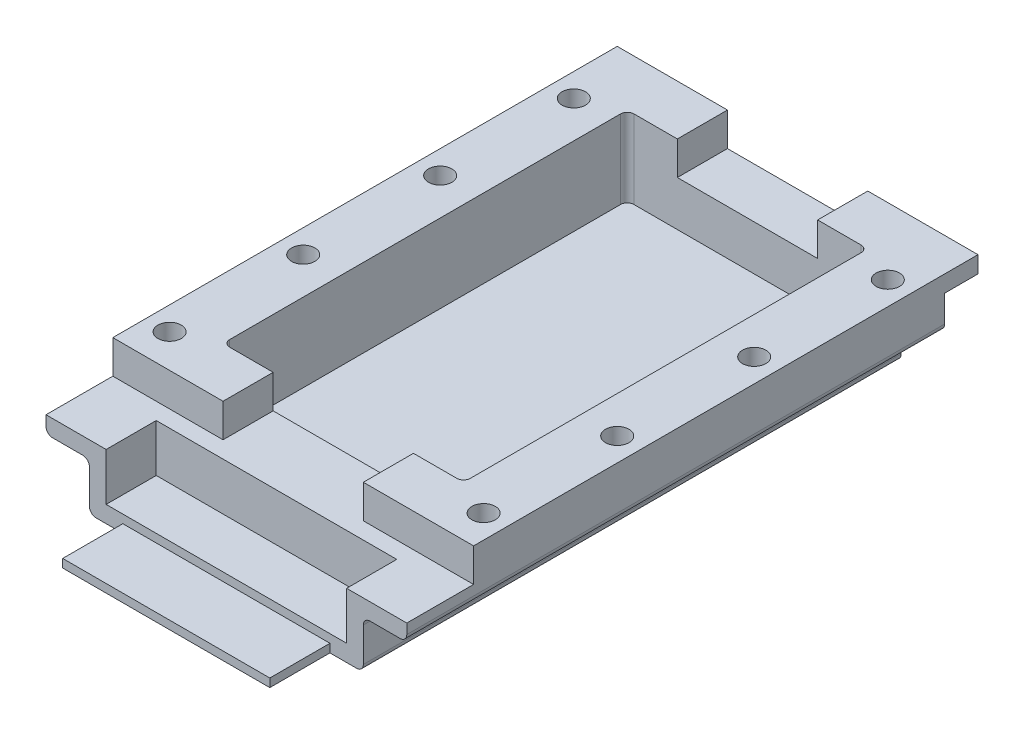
from build123d import *

# Parameters (mm, degrees)
CROQUIS1_W                   = 72
CROQUIS1_H                   = 23.5
SALIENTE_EXTRUIR1_DEPTH      = 15
SALIENTE_EXTRUIR2_DEPTH      = 136
SALIENTE_EXTRUIR2_DEPTH_BACK = 5
CROQUIS6_W                   = 18
CROQUIS6_H                   = 10
SALIENTE_EXTRUIR6_DEPTH      = 5
CROQUIS7_W                   = 62
CROQUIS7_H                   = 18
CORTAR_EXTRUIR1_DEPTH        = 2.5
SALIENTE_EXTRUIR7_REACH      = 180.204
CROQUIS8_W                   = 72
CROQUIS8_H                   = 15
SALIENTE_EXTRUIR8_DEPTH      = 20
CROQUIS10_W                  = 72
CROQUIS10_H                  = 14.25
CORTAR_EXTRUIR2_DEPTH        = 15
CROQUIS11_W                  = 62
CROQUIS11_H                  = 18
SALIENTE_EXTRUIR9_DEPTH      = 2.5
REDONDEO8_R                  = 2
CROQUIS13_W                  = 42
CROQUIS13_H                  = 171
CORTAR_EXTRUIR6_DEPTH        = 10
CROQUIS14_W                  = 5
CROQUIS14_H                  = 15
CORTAR_EXTRUIR7_DEPTH        = 30
REDONDEO9_R                  = 2
REDONDEO10_R                 = 2
CROQUIS15_R                  = 3.5
CORTAR_EXTRUIR8_DEPTH        = 212.368310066
CORTAR_EXTRUIR9_DEPTH        = 10
CORTAR_EXTRUIR9_DEPTH_BACK   = 7
CROQUIS16_R                  = 5.25


with BuildPart() as part:
    # Croquis1 → Saliente-Extruir1 (new body)
    with BuildSketch(Plane.XY):
        with Locations((36, 11.75)):
            Rectangle(CROQUIS1_W, CROQUIS1_H)
    extrude(amount=SALIENTE_EXTRUIR1_DEPTH)

    # Croquis2 → Saliente-Extruir2 (add, two sides: drawn at the far end of the back side and taken through both)
    with BuildSketch(Plane.XY.offset(15).offset(-SALIENTE_EXTRUIR2_DEPTH_BACK)):
        Polygon((0, 23.5), (-18, 23.5), (-18, 8.5), (-5, 8.5), (-5, -5.75), (77, -5.75), (77, 8.5), (90, 8.5), (90, 23.5), (72, 23.5), (72, 0), (0, 0), align=None)
    extrude(amount=SALIENTE_EXTRUIR2_DEPTH + SALIENTE_EXTRUIR2_DEPTH_BACK)

    # Croquis6 → Saliente-Extruir6 (add)
    with BuildSketch(Plane(origin=(0, 23.5, 0), x_dir=(1, 0, 0), z_dir=(0, 1, 0))):
        with Locations((-9, -5)):
            Rectangle(CROQUIS6_W, CROQUIS6_H)
        with Locations((81, -5)):
            Rectangle(CROQUIS6_W, CROQUIS6_H)
    extrude(amount=-SALIENTE_EXTRUIR6_DEPTH)

    # Croquis7 → Cortar-Extruir1 (cut)
    with BuildSketch(Plane.XZ.offset(5.75)):
        with Locations((36, 19)):
            Rectangle(CROQUIS7_W, CROQUIS7_H)
    extrude(amount=-CORTAR_EXTRUIR1_DEPTH, mode=Mode.SUBTRACT)

    # Croquis8 → Saliente-Extruir7 (add, up to next)
    with BuildSketch(Plane(origin=(0, 23.5, 0), x_dir=(1, 0, 0), z_dir=(0, 1, 0)), mode=Mode.PRIVATE) as saliente_extruir7_sk1:
        with Locations((36, -143.5)):
            Rectangle(CROQUIS8_W, CROQUIS8_H)
    saliente_extruir7_tool1 = extrude(saliente_extruir7_sk1.sketch, amount=-SALIENTE_EXTRUIR7_REACH, mode=Mode.PRIVATE) - part.part
    add(saliente_extruir7_tool1.solids().sort_by_distance((36, 23.5, 143.5))[0])

    # Croquis9 → Saliente-Extruir8 (add)
    with BuildSketch(Plane.XY.offset(151)):
        Polygon((-18, 13.5), (90, 13.5), (90, 8.5), (77, 8.5), (77, -5.75), (-5, -5.75), (-5, 8.5), (-18, 8.5), align=None)
    extrude(amount=SALIENTE_EXTRUIR8_DEPTH)

    # Croquis10 → Cortar-Extruir2 (cut)
    with BuildSketch(Plane.XY.offset(171)):
        with Locations((36, 6.375)):
            Rectangle(CROQUIS10_W, CROQUIS10_H)
    extrude(amount=-CORTAR_EXTRUIR2_DEPTH, mode=Mode.SUBTRACT)

    # Croquis11 → Saliente-Extruir9 (add)
    with BuildSketch(Plane.XZ.offset(5.75)):
        with Locations((36, 180)):
            Rectangle(CROQUIS11_W, CROQUIS11_H)
    extrude(amount=-SALIENTE_EXTRUIR9_DEPTH)

    # Redondeo8
    redondeo8_edges = [part.edges().sort_by_distance(p)[0] for p in [
        (90, 8.5, 90.5),
        (77, 8.5, 90.5),
        (77, -5.75, 90.5),
        (-5, -5.75, 90.5),
        (-5, 8.5, 90.5),
        (-18, 8.5, 90.5),
    ]]
    fillet(redondeo8_edges, radius=REDONDEO8_R)

    # Croquis13 → Cortar-Extruir6 (cut)
    with BuildSketch(Plane(origin=(0, 23.5, 0), x_dir=(1, 0, 0), z_dir=(0, 1, 0))):
        with Locations((36, -85.5)):
            Rectangle(CROQUIS13_W, CROQUIS13_H)
    extrude(amount=-CORTAR_EXTRUIR6_DEPTH, mode=Mode.SUBTRACT)

    # Croquis14 → Cortar-Extruir7 (cut)
    with BuildSketch(Plane(origin=(0, 0, 0), x_dir=(-1, 0, 0), z_dir=(0, 0, -1))):
        with Locations((-72.5, 7.5)):
            Rectangle(CROQUIS14_W, CROQUIS14_H)
    extrude(amount=-CORTAR_EXTRUIR7_DEPTH, mode=Mode.SUBTRACT)

    # Redondeo9
    redondeo9_edges = [part.edges().sort_by_distance(p)[0] for p in [
        (75, 7.5, 30),
        (73.5, 15, 30),
        (75, 15, 20),
    ]]
    fillet(redondeo9_edges, radius=REDONDEO9_R)

    # Redondeo10
    redondeo10_edges = [part.edges().sort_by_distance(p)[0] for p in [
        (72, 11.75, 136),
        (0, 11.75, 136),
        (0, 11.75, 15),
        (72, 19.25, 15),
    ]]
    fillet(redondeo10_edges, radius=REDONDEO10_R)

    # Croquis15 → Cortar-Extruir8 (cut, through all)
    with BuildSketch(Plane(origin=(0, 23.5, 0), x_dir=(1, 0, 0), z_dir=(0, 1, 0))):
        with Locations(Location((83, -20, 0), (0, 0, 270))):
            Circle(CROQUIS15_R)
        with Locations(Location((83, -60, 0), (0, 0, 270))):
            Circle(CROQUIS15_R)
        with Locations(Location((83, -101, 0), (0, 0, 270))):
            Circle(CROQUIS15_R)
        with Locations(Location((83, -141, 0), (0, 0, 270))):
            Circle(CROQUIS15_R)
        with Locations(Location((-11, -20, 0), (0, 0, 270))):
            Circle(CROQUIS15_R)
        with Locations(Location((-11, -60, 0), (0, 0, 270))):
            Circle(CROQUIS15_R)
        with Locations(Location((-11, -101, 0), (0, 0, 270))):
            Circle(CROQUIS15_R)
        with Locations(Location((-11, -141, 0), (0, 0, 270))):
            Circle(CROQUIS15_R)
    extrude(amount=-CORTAR_EXTRUIR8_DEPTH, mode=Mode.SUBTRACT)

    # Croquis16 → Cortar-Extruir9 (cut, two sides: drawn at the far end of the back side and taken through both)
    with BuildSketch(Plane.XZ.offset(-8.5).offset(-CORTAR_EXTRUIR9_DEPTH_BACK)):
        with Locations(Location((-11, 141, 0), (0, 0, 40.367593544))):
            Circle(CROQUIS16_R)
        with Locations(Location((-11, 101, 0), (0, 0, 40.367593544))):
            Circle(CROQUIS16_R)
        with Locations(Location((-11, 60, 0), (0, 0, 40.367593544))):
            Circle(CROQUIS16_R)
        with Locations(Location((-11, 20, 0), (0, 0, 40.367593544))):
            Circle(CROQUIS16_R)
        with Locations(Location((83, 20, 0), (0, 0, 139.632406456))):
            Circle(CROQUIS16_R)
        with Locations(Location((83, 60, 0), (0, 0, 139.632406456))):
            Circle(CROQUIS16_R)
        with Locations(Location((83, 101, 0), (0, 0, 139.632406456))):
            Circle(CROQUIS16_R)
        with Locations(Location((83, 141, 0), (0, 0, 139.632406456))):
            Circle(CROQUIS16_R)
    extrude(amount=CORTAR_EXTRUIR9_DEPTH + CORTAR_EXTRUIR9_DEPTH_BACK, mode=Mode.SUBTRACT)


solid = part.part
